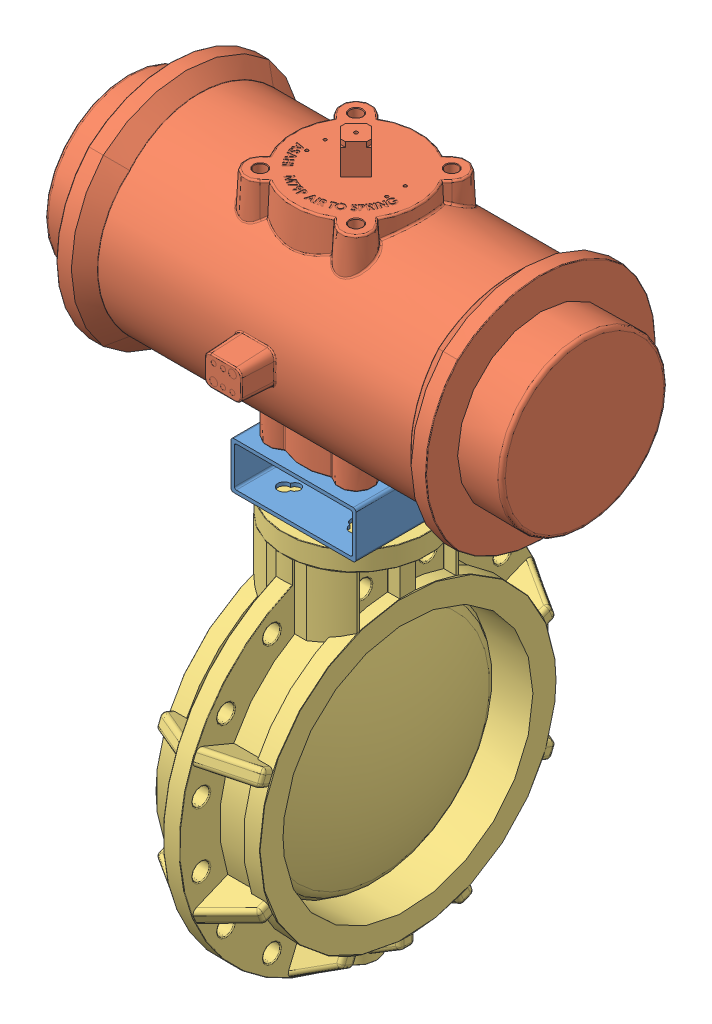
SolidWorks assembly T56BF_16IN_AS.SLDASM, configuration Default (file format 3800). Lengths in mm.
Overall size (742.5 1149.04 599.95).
3 component instances, 3 part files, 9 mates.
Components (placement in the parent):
- 14_16_AS-BKT-1: 14_16_AS-BKT.SLDPRT [Default] at origin size (203.2 76.2 203.2)
- M79P_AIR_SPR-1: M79P_AIR_SPR.SLDPRT [Default] at (101.6 267.2 -101.6) size (742.5 428 402.5)
- T56BF_16-1: T56BF_16.SLDPRT [Default] at (101.6 -343.916 -101.6) x (0 0 1) z (-1 0 0) size (599.95 755.97 234.95)
Mates (geometry in assembly coordinates):
- Coincident1: coincident aligned: plane of 14_16_AS-BKT-1 through (0 0 0) normal (0 0 1)
- Coincident2: coincident aligned: unknown of 14_16_AS-BKT-1
- Coincident3: coincident aligned: unknown of 14_16_AS-BKT-1
- Concentric2: concentric aligned: cylinder of 14_16_AS-BKT-1; circle of M79P_AIR_SPR-1
- Coincident6: coincident anti-aligned: plane of 14_16_AS-BKT-1 through (0 76.2 -203.2) normal (0 1 0); plane of M79P_AIR_SPR-1 through (53.6445 76.2 -32.0922) normal (0 -1 0)
- Parallel3: parallel aligned: plane of 14_16_AS-BKT-1 through (203.2 76.2 -203.2) normal (1 0 0); plane of M79P_AIR_SPR-1 through (472.85 267.2 -101.6) normal (1 0 0)
- Concentric3: concentric aligned: circle of 14_16_AS-BKT-1; cylinder of ?
- Parallel4: parallel aligned: plane of ?; plane of ?
- Coincident8: coincident anti-aligned: plane of ?; plane of ?
